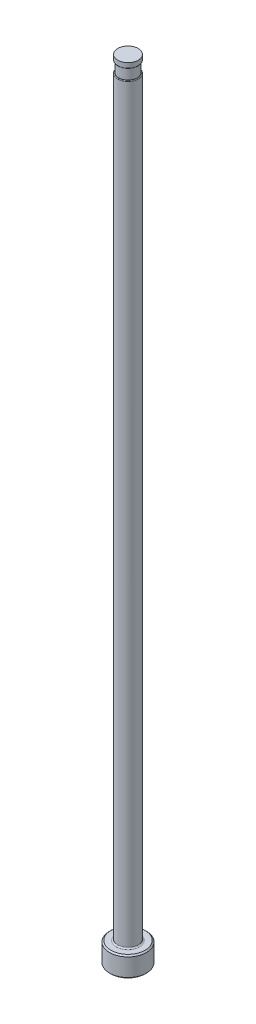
from build123d import *

# Parameters (mm, degrees)
CHAMFER1_SIZE     = 0.254
FILLET1_R         = 0.254
SKETCH2_W         = 0.2032
SKETCH2_H         = 2.032
D_SLOT_DEPTH      = 153.483544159
D_SLOT_DEPTH_BACK = 153.483544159
SKETCH5_W         = 0.00508
SKETCH5_H         = 1.016
FILLET2_R         = 0.127


with BuildPart() as part:
    # Sketch1 → Revolve1 (revolve)
    with BuildSketch(Plane.XY, mode=Mode.PRIVATE) as revolve1_sk:
        Polygon((0, 0), (-3.5687, 0), (-3.5687, 3.9624), (-1.98374, 3.9624), (-1.98374, 152.4), (0, 152.4), align=None)
    revolve(revolve1_sk.sketch.rotate(Axis((0, 259.958771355, 0), (0, -1, 0)), 270), axis=Axis((0, 259.958771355, 0), (0, -1, 0)))

    # Chamfer1
    chamfer1_edges = [part.edges().sort_by_distance(p)[0] for p in [
        (0, 3.9624, -3.5687),
        (0, 0, -3.5687),
    ]]
    chamfer(chamfer1_edges, length=CHAMFER1_SIZE)

    # Fillet1
    fillet1_edges = [part.edges().sort_by_distance(p)[0] for p in [
        (0, 3.9624, -1.98374),
    ]]
    fillet(fillet1_edges, radius=FILLET1_R)

    # Sketch2 → Vent Relief (revolve, cut)
    with BuildSketch(Plane.XY, mode=Mode.PRIVATE) as vent_relief_sk:
        with Locations((-1.88214, 150.368)):
            Rectangle(SKETCH2_W, SKETCH2_H)
    revolve(vent_relief_sk.sketch.rotate(Axis((0, 153.448281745, 0), (0, -1, 0)), 270), axis=Axis((0, 153.448281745, 0), (0, -1, 0)), mode=Mode.SUBTRACT)

    # Sketch3 → D-Slot (cut, two sides: drawn at the far end of the back side and taken through both)
    with BuildSketch(Plane.XY.offset(-D_SLOT_DEPTH_BACK)):
        with BuildLine():
            Line((-1.78054, 150.368), (-1.78054, 86.868))
            ThreePointArc((-1.78054, 86.868), (-1.831753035, 86.300038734), (-1.98374, 85.7504))
            Line((-1.98374, 85.7504), (-1.98374, 150.368))
            Line((-1.98374, 150.368), (-1.78054, 150.368))
        make_face()
    extrude(amount=D_SLOT_DEPTH + D_SLOT_DEPTH_BACK, mode=Mode.SUBTRACT)

    # Sketch5 → Vent Diameter (revolve, cut)
    with BuildSketch(Plane.XY, mode=Mode.PRIVATE) as vent_diameter_sk:
        with Locations((-1.9812, 151.892)):
            Rectangle(SKETCH5_W, SKETCH5_H)
    revolve(vent_diameter_sk.sketch.rotate(Axis((0, 152.687735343, 0), (0, -1, 0)), 90), axis=Axis((0, 152.687735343, 0), (0, -1, 0)), mode=Mode.SUBTRACT)

    # Fillet2
    fillet2_edges = [part.edges().sort_by_distance(p)[0] for p in [
        (1.683772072, 149.352, -1.04887368),
        (0, 151.384, 1.97866),
    ]]
    fillet(fillet2_edges, radius=FILLET2_R)


solid = part.part
